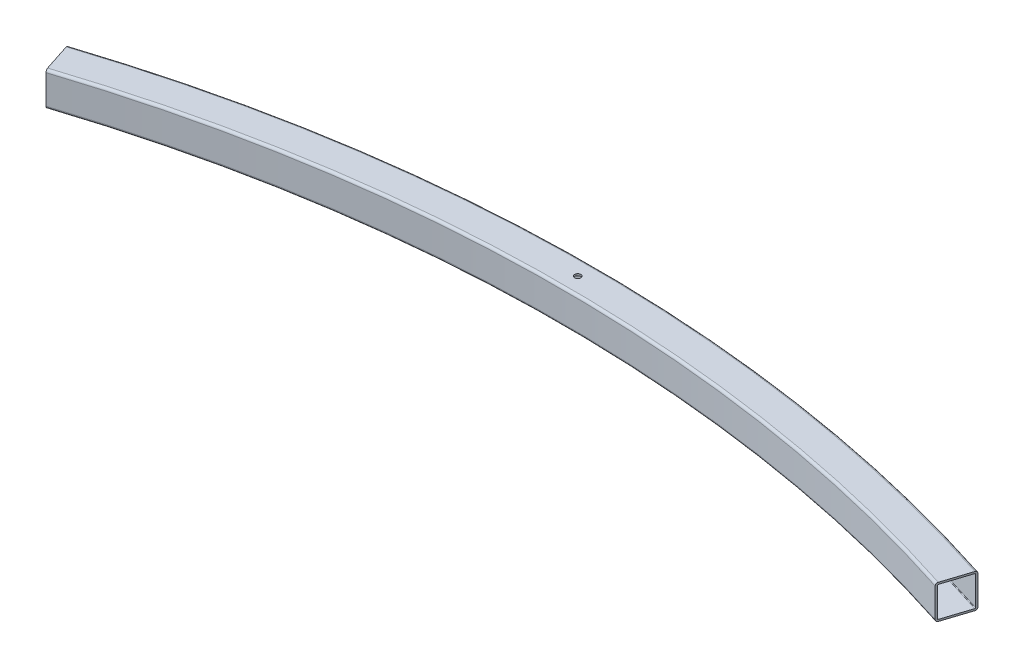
ISO-10303-21;
HEADER;
FILE_DESCRIPTION(('STEP AP214'),'2;1');
FILE_NAME('part.step','',(''),(''),'','','');
FILE_SCHEMA(('AUTOMOTIVE_DESIGN { 1 0 10303 214 1 1 1 1 }'));
ENDSEC;
DATA;
#1=APPLICATION_CONTEXT('core data for automotive mechanical design processes');
#2=APPLICATION_PROTOCOL_DEFINITION('international standard','automotive_design',2000,#1);
#3=PRODUCT_CONTEXT('',#1,'mechanical');
#4=PRODUCT('Part','Part','',(#3));
#5=PRODUCT_RELATED_PRODUCT_CATEGORY('part','',(#4));
#6=PRODUCT_DEFINITION_FORMATION('','',#4);
#7=PRODUCT_DEFINITION_CONTEXT('part definition',#1,'design');
#8=PRODUCT_DEFINITION('design','',#6,#7);
#9=PRODUCT_DEFINITION_SHAPE('','',#8);
#10=(LENGTH_UNIT() NAMED_UNIT(*) SI_UNIT(.MILLI.,.METRE.));
#11=(NAMED_UNIT(*) PLANE_ANGLE_UNIT() SI_UNIT($,.RADIAN.));
#12=(NAMED_UNIT(*) SI_UNIT($,.STERADIAN.) SOLID_ANGLE_UNIT());
#13=UNCERTAINTY_MEASURE_WITH_UNIT(LENGTH_MEASURE(1.E-05),#10,'distance_accuracy_value','');
#14=(GEOMETRIC_REPRESENTATION_CONTEXT(3) GLOBAL_UNCERTAINTY_ASSIGNED_CONTEXT((#13)) GLOBAL_UNIT_ASSIGNED_CONTEXT((#10,
#11,#12)) REPRESENTATION_CONTEXT('',''));
#15=CARTESIAN_POINT('',(0.,0.,0.));
#16=DIRECTION('',(0.,0.,1.));
#17=DIRECTION('',(1.,0.,0.));
#18=AXIS2_PLACEMENT_3D('',#15,#16,#17);
#19=CARTESIAN_POINT('',(0.,64.77,2965.075));
#20=DIRECTION('',(0.,1.,0.));
#21=DIRECTION('',(0.,0.,1.));
#22=AXIS2_PLACEMENT_3D('',#19,#20,#21);
#23=TOROIDAL_SURFACE('',#22,2970.155,1.27);
#24=CARTESIAN_POINT('',(0.,64.77,2965.075));
#25=DIRECTION('',(0.,1.,0.));
#26=DIRECTION('',(0.,0.,1.));
#27=AXIS2_PLACEMENT_3D('',#24,#25,#26);
#28=CIRCLE('',#27,2968.885);
#29=CARTESIAN_POINT('',(914.985616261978,64.77,140.702597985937));
#30=VERTEX_POINT('',#29);
#31=CARTESIAN_POINT('',(-914.985616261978,64.77,140.702597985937));
#32=VERTEX_POINT('',#31);
#33=EDGE_CURVE('E12',#30,#32,#28,.T.);
#34=ORIENTED_EDGE('',*,*,#33,.T.);
#35=CARTESIAN_POINT('',(-915.377019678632,64.77,139.494416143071));
#36=DIRECTION('',(0.951324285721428,0.,-0.308191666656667));
#37=DIRECTION('',(0.308191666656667,0.,0.951324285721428));
#38=AXIS2_PLACEMENT_3D('',#35,#36,#37);
#39=CIRCLE('',#38,1.27);
#40=CARTESIAN_POINT('',(-915.377019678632,66.04,139.494416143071));
#41=VERTEX_POINT('',#40);
#42=EDGE_CURVE('E204',#41,#32,#39,.T.);
#43=ORIENTED_EDGE('',*,*,#42,.F.);
#44=CARTESIAN_POINT('',(0.,66.04,2965.075));
#45=DIRECTION('',(0.,1.,0.));
#46=DIRECTION('',(0.,0.,1.));
#47=AXIS2_PLACEMENT_3D('',#44,#45,#46);
#48=CIRCLE('',#47,2970.155);
#49=CARTESIAN_POINT('',(915.377019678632,66.04,139.494416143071));
#50=VERTEX_POINT('',#49);
#51=EDGE_CURVE('E282',#50,#41,#48,.T.);
#52=ORIENTED_EDGE('',*,*,#51,.F.);
#53=CARTESIAN_POINT('',(915.377019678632,64.77,139.494416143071));
#54=DIRECTION('',(0.951324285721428,0.,0.308191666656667));
#55=DIRECTION('',(-0.308191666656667,0.,0.951324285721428));
#56=AXIS2_PLACEMENT_3D('',#53,#54,#55);
#57=CIRCLE('',#56,1.27);
#58=EDGE_CURVE('E249',#50,#30,#57,.T.);
#59=ORIENTED_EDGE('',*,*,#58,.T.);
#60=EDGE_LOOP('',(#34,#43,#52,#59));
#61=FACE_BOUND('',#60,.T.);
#62=ADVANCED_FACE('F43',(#61),#23,.F.);
#63=CARTESIAN_POINT('',(0.,0.,2965.075));
#64=DIRECTION('',(0.,1.,0.));
#65=DIRECTION('',(0.,0.,1.));
#66=AXIS2_PLACEMENT_3D('',#63,#64,#65);
#67=CYLINDRICAL_SURFACE('',#66,2968.885);
#68=CARTESIAN_POINT('',(0.,5.08,2965.075));
#69=DIRECTION('',(0.,1.,0.));
#70=DIRECTION('',(0.,0.,1.));
#71=AXIS2_PLACEMENT_3D('',#68,#69,#70);
#72=CIRCLE('',#71,2968.885);
#73=CARTESIAN_POINT('',(914.985616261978,5.08,140.702597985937));
#74=VERTEX_POINT('',#73);
#75=CARTESIAN_POINT('',(-914.985616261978,5.08,140.702597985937));
#76=VERTEX_POINT('',#75);
#77=EDGE_CURVE('E52',#74,#76,#72,.T.);
#78=ORIENTED_EDGE('',*,*,#77,.T.);
#79=DIRECTION('',(0.,-1.,0.));
#80=VECTOR('',#79,1.);
#81=CARTESIAN_POINT('',(-914.985616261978,5.08000000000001,140.702597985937));
#82=LINE('',#81,#80);
#83=EDGE_CURVE('E225',#32,#76,#82,.T.);
#84=ORIENTED_EDGE('',*,*,#83,.F.);
#85=ORIENTED_EDGE('',*,*,#33,.F.);
#86=DIRECTION('',(0.,-1.,0.));
#87=VECTOR('',#86,1.);
#88=CARTESIAN_POINT('',(914.985616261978,5.08000000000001,140.702597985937));
#89=LINE('',#88,#87);
#90=EDGE_CURVE('E168',#30,#74,#89,.T.);
#91=ORIENTED_EDGE('',*,*,#90,.T.);
#92=EDGE_LOOP('',(#78,#84,#85,#91));
#93=FACE_BOUND('',#92,.T.);
#94=ADVANCED_FACE('F45',(#93),#67,.T.);
#95=CARTESIAN_POINT('',(0.,5.08,2965.075));
#96=DIRECTION('',(0.,1.,0.));
#97=DIRECTION('',(0.,0.,1.));
#98=AXIS2_PLACEMENT_3D('',#95,#96,#97);
#99=TOROIDAL_SURFACE('',#98,2970.155,1.27);
#100=CARTESIAN_POINT('',(0.,3.81,2965.075));
#101=DIRECTION('',(0.,1.,0.));
#102=DIRECTION('',(0.,0.,1.));
#103=AXIS2_PLACEMENT_3D('',#100,#101,#102);
#104=CIRCLE('',#103,2970.155);
#105=CARTESIAN_POINT('',(915.377019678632,3.81,139.494416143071));
#106=VERTEX_POINT('',#105);
#107=CARTESIAN_POINT('',(-915.377019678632,3.81,139.494416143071));
#108=VERTEX_POINT('',#107);
#109=EDGE_CURVE('E292',#106,#108,#104,.T.);
#110=ORIENTED_EDGE('',*,*,#109,.T.);
#111=CARTESIAN_POINT('',(-915.377019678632,5.08,139.494416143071));
#112=DIRECTION('',(0.951324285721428,0.,-0.308191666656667));
#113=DIRECTION('',(0.308191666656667,0.,0.951324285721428));
#114=AXIS2_PLACEMENT_3D('',#111,#112,#113);
#115=CIRCLE('',#114,1.27);
#116=EDGE_CURVE('E222',#76,#108,#115,.T.);
#117=ORIENTED_EDGE('',*,*,#116,.F.);
#118=ORIENTED_EDGE('',*,*,#77,.F.);
#119=CARTESIAN_POINT('',(915.377019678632,5.08,139.494416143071));
#120=DIRECTION('',(0.951324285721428,0.,0.308191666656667));
#121=DIRECTION('',(-0.308191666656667,0.,0.951324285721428));
#122=AXIS2_PLACEMENT_3D('',#119,#120,#121);
#123=CIRCLE('',#122,1.27);
#124=EDGE_CURVE('E267',#74,#106,#123,.T.);
#125=ORIENTED_EDGE('',*,*,#124,.T.);
#126=EDGE_LOOP('',(#110,#117,#118,#125));
#127=FACE_BOUND('',#126,.T.);
#128=ADVANCED_FACE('F294',(#127),#99,.F.);
#129=CARTESIAN_POINT('',(915.377019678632,3.81,139.494416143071));
#130=DIRECTION('',(0.,1.,0.));
#131=DIRECTION('',(0.,0.,1.));
#132=AXIS2_PLACEMENT_3D('',#129,#130,#131);
#133=PLANE('',#132);
#134=CARTESIAN_POINT('',(0.,3.81,-34.9250000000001));
#135=DIRECTION('',(0.,1.,0.));
#136=DIRECTION('',(0.,0.,1.));
#137=AXIS2_PLACEMENT_3D('',#134,#135,#136);
#138=CIRCLE('',#137,6.35);
#139=CARTESIAN_POINT('',(0.,3.81,-28.5750000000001));
#140=VERTEX_POINT('',#139);
#141=EDGE_CURVE('E183',#140,#140,#138,.T.);
#142=ORIENTED_EDGE('',*,*,#141,.F.);
#143=EDGE_LOOP('',(#142));
#144=FACE_BOUND('',#143,.T.);
#145=CARTESIAN_POINT('',(0.,3.81,2965.075));
#146=DIRECTION('',(0.,1.,0.));
#147=DIRECTION('',(0.,0.,1.));
#148=AXIS2_PLACEMENT_3D('',#145,#146,#147);
#149=CIRCLE('',#148,3029.845);
#150=CARTESIAN_POINT('',(933.772980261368,3.81,82.7098695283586));
#151=VERTEX_POINT('',#150);
#152=CARTESIAN_POINT('',(-933.772980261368,3.81,82.7098695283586));
#153=VERTEX_POINT('',#152);
#154=EDGE_CURVE('E290',#151,#153,#149,.T.);
#155=ORIENTED_EDGE('',*,*,#154,.T.);
#156=DIRECTION('',(-0.308191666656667,0.,-0.951324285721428));
#157=VECTOR('',#156,1.);
#158=CARTESIAN_POINT('',(-915.377019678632,3.81,139.494416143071));
#159=LINE('',#158,#157);
#160=EDGE_CURVE('E219',#108,#153,#159,.T.);
#161=ORIENTED_EDGE('',*,*,#160,.F.);
#162=ORIENTED_EDGE('',*,*,#109,.F.);
#163=DIRECTION('',(0.308191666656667,0.,-0.951324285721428));
#164=VECTOR('',#163,1.);
#165=CARTESIAN_POINT('',(915.377019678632,3.81,139.494416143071));
#166=LINE('',#165,#164);
#167=EDGE_CURVE('E264',#106,#151,#166,.T.);
#168=ORIENTED_EDGE('',*,*,#167,.T.);
#169=EDGE_LOOP('',(#155,#161,#162,#168));
#170=FACE_BOUND('',#169,.T.);
#171=ADVANCED_FACE('F308',(#144,#170),#133,.T.);
#172=CARTESIAN_POINT('',(0.,5.08,2965.075));
#173=DIRECTION('',(0.,1.,0.));
#174=DIRECTION('',(0.,0.,1.));
#175=AXIS2_PLACEMENT_3D('',#172,#173,#174);
#176=TOROIDAL_SURFACE('',#175,3029.845,1.27);
#177=CARTESIAN_POINT('',(0.,5.08000000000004,2965.075));
#178=DIRECTION('',(0.,1.,0.));
#179=DIRECTION('',(0.,0.,1.));
#180=AXIS2_PLACEMENT_3D('',#177,#178,#179);
#181=CIRCLE('',#180,3031.115);
#182=CARTESIAN_POINT('',(934.164383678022,5.08000000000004,81.5016876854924));
#183=VERTEX_POINT('',#182);
#184=CARTESIAN_POINT('',(-934.164383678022,5.08000000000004,81.5016876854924));
#185=VERTEX_POINT('',#184);
#186=EDGE_CURVE('E288',#183,#185,#181,.T.);
#187=ORIENTED_EDGE('',*,*,#186,.T.);
#188=CARTESIAN_POINT('',(-933.772980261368,5.08,82.7098695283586));
#189=DIRECTION('',(0.951324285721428,0.,-0.308191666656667));
#190=DIRECTION('',(-0.308191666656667,0.,-0.951324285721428));
#191=AXIS2_PLACEMENT_3D('',#188,#189,#190);
#192=CIRCLE('',#191,1.27);
#193=EDGE_CURVE('E216',#153,#185,#192,.T.);
#194=ORIENTED_EDGE('',*,*,#193,.F.);
#195=ORIENTED_EDGE('',*,*,#154,.F.);
#196=CARTESIAN_POINT('',(933.772980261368,5.08,82.7098695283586));
#197=DIRECTION('',(0.951324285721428,0.,0.308191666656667));
#198=DIRECTION('',(0.308191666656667,0.,-0.951324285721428));
#199=AXIS2_PLACEMENT_3D('',#196,#197,#198);
#200=CIRCLE('',#199,1.27);
#201=EDGE_CURVE('E261',#151,#183,#200,.T.);
#202=ORIENTED_EDGE('',*,*,#201,.T.);
#203=EDGE_LOOP('',(#187,#194,#195,#202));
#204=FACE_BOUND('',#203,.T.);
#205=ADVANCED_FACE('F312',(#204),#176,.F.);
#206=CARTESIAN_POINT('',(0.,0.,2965.075));
#207=DIRECTION('',(0.,1.,0.));
#208=DIRECTION('',(0.,0.,1.));
#209=AXIS2_PLACEMENT_3D('',#206,#207,#208);
#210=CYLINDRICAL_SURFACE('',#209,3031.115);
#211=CARTESIAN_POINT('',(0.,64.77,2965.075));
#212=DIRECTION('',(0.,1.,0.));
#213=DIRECTION('',(0.,0.,1.));
#214=AXIS2_PLACEMENT_3D('',#211,#212,#213);
#215=CIRCLE('',#214,3031.115);
#216=CARTESIAN_POINT('',(934.164383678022,64.77,81.5016876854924));
#217=VERTEX_POINT('',#216);
#218=CARTESIAN_POINT('',(-934.164383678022,64.77,81.5016876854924));
#219=VERTEX_POINT('',#218);
#220=EDGE_CURVE('E286',#217,#219,#215,.T.);
#221=ORIENTED_EDGE('',*,*,#220,.T.);
#222=DIRECTION('',(0.,1.,0.));
#223=VECTOR('',#222,1.);
#224=CARTESIAN_POINT('',(-934.164383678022,5.08000000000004,81.5016876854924));
#225=LINE('',#224,#223);
#226=EDGE_CURVE('E213',#185,#219,#225,.T.);
#227=ORIENTED_EDGE('',*,*,#226,.F.);
#228=ORIENTED_EDGE('',*,*,#186,.F.);
#229=DIRECTION('',(0.,1.,0.));
#230=VECTOR('',#229,1.);
#231=CARTESIAN_POINT('',(934.164383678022,5.08000000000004,81.5016876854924));
#232=LINE('',#231,#230);
#233=EDGE_CURVE('E258',#183,#217,#232,.T.);
#234=ORIENTED_EDGE('',*,*,#233,.T.);
#235=EDGE_LOOP('',(#221,#227,#228,#234));
#236=FACE_BOUND('',#235,.T.);
#237=ADVANCED_FACE('F314',(#236),#210,.F.);
#238=CARTESIAN_POINT('',(0.,64.77,2965.075));
#239=DIRECTION('',(0.,1.,0.));
#240=DIRECTION('',(0.,0.,1.));
#241=AXIS2_PLACEMENT_3D('',#238,#239,#240);
#242=TOROIDAL_SURFACE('',#241,3029.845,1.27000000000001);
#243=CARTESIAN_POINT('',(0.,66.04,2965.075));
#244=DIRECTION('',(0.,1.,0.));
#245=DIRECTION('',(0.,0.,1.));
#246=AXIS2_PLACEMENT_3D('',#243,#244,#245);
#247=CIRCLE('',#246,3029.845);
#248=CARTESIAN_POINT('',(933.772980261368,66.04,82.7098695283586));
#249=VERTEX_POINT('',#248);
#250=CARTESIAN_POINT('',(-933.772980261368,66.04,82.7098695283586));
#251=VERTEX_POINT('',#250);
#252=EDGE_CURVE('E284',#249,#251,#247,.T.);
#253=ORIENTED_EDGE('',*,*,#252,.T.);
#254=CARTESIAN_POINT('',(-933.772980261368,64.77,82.7098695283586));
#255=DIRECTION('',(0.951324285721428,0.,-0.308191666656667));
#256=DIRECTION('',(0.308191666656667,0.,0.951324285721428));
#257=AXIS2_PLACEMENT_3D('',#254,#255,#256);
#258=CIRCLE('',#257,1.27000000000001);
#259=EDGE_CURVE('E210',#219,#251,#258,.T.);
#260=ORIENTED_EDGE('',*,*,#259,.F.);
#261=ORIENTED_EDGE('',*,*,#220,.F.);
#262=CARTESIAN_POINT('',(933.772980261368,64.77,82.7098695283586));
#263=DIRECTION('',(0.951324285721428,0.,0.308191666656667));
#264=DIRECTION('',(-0.308191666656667,0.,0.951324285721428));
#265=AXIS2_PLACEMENT_3D('',#262,#263,#264);
#266=CIRCLE('',#265,1.27000000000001);
#267=EDGE_CURVE('E255',#217,#249,#266,.T.);
#268=ORIENTED_EDGE('',*,*,#267,.T.);
#269=EDGE_LOOP('',(#253,#260,#261,#268));
#270=FACE_BOUND('',#269,.T.);
#271=ADVANCED_FACE('F317',(#270),#242,.F.);
#272=CARTESIAN_POINT('',(0.,5.08,2965.075));
#273=DIRECTION('',(0.,1.,0.));
#274=DIRECTION('',(0.,0.,1.));
#275=AXIS2_PLACEMENT_3D('',#272,#273,#274);
#276=TOROIDAL_SURFACE('',#275,2970.155,5.08);
#277=CARTESIAN_POINT('',(0.,5.08000000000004,2965.075));
#278=DIRECTION('',(0.,1.,0.));
#279=DIRECTION('',(0.,0.,1.));
#280=AXIS2_PLACEMENT_3D('',#277,#278,#279);
#281=CIRCLE('',#280,2965.075);
#282=CARTESIAN_POINT('',(913.811406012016,5.08000000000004,144.327143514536));
#283=VERTEX_POINT('',#282);
#284=CARTESIAN_POINT('',(-913.811406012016,5.08000000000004,144.327143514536));
#285=VERTEX_POINT('',#284);
#286=EDGE_CURVE('E181',#283,#285,#281,.T.);
#287=ORIENTED_EDGE('',*,*,#286,.T.);
#288=CARTESIAN_POINT('',(-915.377019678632,5.08,139.494416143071));
#289=DIRECTION('',(0.951324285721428,0.,-0.308191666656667));
#290=DIRECTION('',(0.308191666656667,0.,0.951324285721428));
#291=AXIS2_PLACEMENT_3D('',#288,#289,#290);
#292=CIRCLE('',#291,5.08);
#293=CARTESIAN_POINT('',(-915.377019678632,0.,139.494416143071));
#294=VERTEX_POINT('',#293);
#295=EDGE_CURVE('E175',#285,#294,#292,.T.);
#296=ORIENTED_EDGE('',*,*,#295,.T.);
#297=CARTESIAN_POINT('',(0.,0.,2965.075));
#298=DIRECTION('',(0.,1.,0.));
#299=DIRECTION('',(0.,0.,1.));
#300=AXIS2_PLACEMENT_3D('',#297,#298,#299);
#301=CIRCLE('',#300,2970.155);
#302=CARTESIAN_POINT('',(915.377019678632,0.,139.494416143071));
#303=VERTEX_POINT('',#302);
#304=EDGE_CURVE('E156',#303,#294,#301,.T.);
#305=ORIENTED_EDGE('',*,*,#304,.F.);
#306=CARTESIAN_POINT('',(915.377019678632,5.08,139.494416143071));
#307=DIRECTION('',(0.951324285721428,0.,0.308191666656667));
#308=DIRECTION('',(-0.308191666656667,0.,0.951324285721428));
#309=AXIS2_PLACEMENT_3D('',#306,#307,#308);
#310=CIRCLE('',#309,5.08);
#311=EDGE_CURVE('E228',#283,#303,#310,.T.);
#312=ORIENTED_EDGE('',*,*,#311,.F.);
#313=EDGE_LOOP('',(#287,#296,#305,#312));
#314=FACE_BOUND('',#313,.T.);
#315=ADVANCED_FACE('F180',(#314),#276,.T.);
#316=CARTESIAN_POINT('',(0.,0.,2965.075));
#317=DIRECTION('',(0.,1.,0.));
#318=DIRECTION('',(0.,0.,1.));
#319=AXIS2_PLACEMENT_3D('',#316,#317,#318);
#320=CYLINDRICAL_SURFACE('',#319,2965.075);
#321=CARTESIAN_POINT('',(0.,64.77,2965.075));
#322=DIRECTION('',(0.,1.,0.));
#323=DIRECTION('',(0.,0.,1.));
#324=AXIS2_PLACEMENT_3D('',#321,#322,#323);
#325=CIRCLE('',#324,2965.075);
#326=CARTESIAN_POINT('',(913.811406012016,64.77,144.327143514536));
#327=VERTEX_POINT('',#326);
#328=CARTESIAN_POINT('',(-913.811406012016,64.77,144.327143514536));
#329=VERTEX_POINT('',#328);
#330=EDGE_CURVE('E279',#327,#329,#325,.T.);
#331=ORIENTED_EDGE('',*,*,#330,.T.);
#332=DIRECTION('',(0.,-1.,0.));
#333=VECTOR('',#332,1.);
#334=CARTESIAN_POINT('',(-913.811406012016,5.08000000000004,144.327143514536));
#335=LINE('',#334,#333);
#336=EDGE_CURVE('E202',#329,#285,#335,.T.);
#337=ORIENTED_EDGE('',*,*,#336,.T.);
#338=ORIENTED_EDGE('',*,*,#286,.F.);
#339=DIRECTION('',(0.,-1.,0.));
#340=VECTOR('',#339,1.);
#341=CARTESIAN_POINT('',(913.811406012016,5.08000000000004,144.327143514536));
#342=LINE('',#341,#340);
#343=EDGE_CURVE('E246',#327,#283,#342,.T.);
#344=ORIENTED_EDGE('',*,*,#343,.F.);
#345=EDGE_LOOP('',(#331,#337,#338,#344));
#346=FACE_BOUND('',#345,.T.);
#347=ADVANCED_FACE('F340',(#346),#320,.F.);
#348=CARTESIAN_POINT('',(0.,64.77,2965.075));
#349=DIRECTION('',(0.,1.,0.));
#350=DIRECTION('',(0.,0.,1.));
#351=AXIS2_PLACEMENT_3D('',#348,#349,#350);
#352=TOROIDAL_SURFACE('',#351,2970.155,5.08);
#353=CARTESIAN_POINT('',(0.,69.85,2965.075));
#354=DIRECTION('',(0.,1.,0.));
#355=DIRECTION('',(0.,0.,1.));
#356=AXIS2_PLACEMENT_3D('',#353,#354,#355);
#357=CIRCLE('',#356,2970.155);
#358=CARTESIAN_POINT('',(915.377019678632,69.85,139.494416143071));
#359=VERTEX_POINT('',#358);
#360=CARTESIAN_POINT('',(-915.377019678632,69.85,139.494416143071));
#361=VERTEX_POINT('',#360);
#362=EDGE_CURVE('E277',#359,#361,#357,.T.);
#363=ORIENTED_EDGE('',*,*,#362,.T.);
#364=CARTESIAN_POINT('',(-915.377019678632,64.77,139.494416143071));
#365=DIRECTION('',(0.951324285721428,0.,-0.308191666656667));
#366=DIRECTION('',(0.308191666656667,0.,0.951324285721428));
#367=AXIS2_PLACEMENT_3D('',#364,#365,#366);
#368=CIRCLE('',#367,5.08);
#369=EDGE_CURVE('E199',#361,#329,#368,.T.);
#370=ORIENTED_EDGE('',*,*,#369,.T.);
#371=ORIENTED_EDGE('',*,*,#330,.F.);
#372=CARTESIAN_POINT('',(915.377019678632,64.77,139.494416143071));
#373=DIRECTION('',(0.951324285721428,0.,0.308191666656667));
#374=DIRECTION('',(-0.308191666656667,0.,0.951324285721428));
#375=AXIS2_PLACEMENT_3D('',#372,#373,#374);
#376=CIRCLE('',#375,5.08);
#377=EDGE_CURVE('E243',#359,#327,#376,.T.);
#378=ORIENTED_EDGE('',*,*,#377,.F.);
#379=EDGE_LOOP('',(#363,#370,#371,#378));
#380=FACE_BOUND('',#379,.T.);
#381=ADVANCED_FACE('F343',(#380),#352,.T.);
#382=CARTESIAN_POINT('',(915.377019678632,69.85,139.494416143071));
#383=DIRECTION('',(0.,-1.,0.));
#384=DIRECTION('',(0.,0.,-1.));
#385=AXIS2_PLACEMENT_3D('',#382,#383,#384);
#386=PLANE('',#385);
#387=CARTESIAN_POINT('',(0.,69.85,-34.9250000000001));
#388=DIRECTION('',(0.,1.,0.));
#389=DIRECTION('',(0.,0.,1.));
#390=AXIS2_PLACEMENT_3D('',#387,#388,#389);
#391=CIRCLE('',#390,6.35);
#392=CARTESIAN_POINT('',(0.,69.85,-28.5750000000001));
#393=VERTEX_POINT('',#392);
#394=EDGE_CURVE('E379',#393,#393,#391,.T.);
#395=ORIENTED_EDGE('',*,*,#394,.F.);
#396=EDGE_LOOP('',(#395));
#397=FACE_BOUND('',#396,.T.);
#398=CARTESIAN_POINT('',(0.,69.85,2965.075));
#399=DIRECTION('',(0.,1.,0.));
#400=DIRECTION('',(0.,0.,1.));
#401=AXIS2_PLACEMENT_3D('',#398,#399,#400);
#402=CIRCLE('',#401,3029.845);
#403=CARTESIAN_POINT('',(933.772980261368,69.85,82.7098695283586));
#404=VERTEX_POINT('',#403);
#405=CARTESIAN_POINT('',(-933.772980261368,69.85,82.7098695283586));
#406=VERTEX_POINT('',#405);
#407=EDGE_CURVE('E275',#404,#406,#402,.T.);
#408=ORIENTED_EDGE('',*,*,#407,.T.);
#409=DIRECTION('',(0.308191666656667,0.,0.951324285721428));
#410=VECTOR('',#409,1.);
#411=CARTESIAN_POINT('',(-915.377019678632,69.85,139.494416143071));
#412=LINE('',#411,#410);
#413=EDGE_CURVE('E196',#406,#361,#412,.T.);
#414=ORIENTED_EDGE('',*,*,#413,.T.);
#415=ORIENTED_EDGE('',*,*,#362,.F.);
#416=DIRECTION('',(-0.308191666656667,0.,0.951324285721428));
#417=VECTOR('',#416,1.);
#418=CARTESIAN_POINT('',(915.377019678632,69.85,139.494416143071));
#419=LINE('',#418,#417);
#420=EDGE_CURVE('E240',#404,#359,#419,.T.);
#421=ORIENTED_EDGE('',*,*,#420,.F.);
#422=EDGE_LOOP('',(#408,#414,#415,#421));
#423=FACE_BOUND('',#422,.T.);
#424=ADVANCED_FACE('F347',(#397,#423),#386,.F.);
#425=CARTESIAN_POINT('',(0.,64.77,2965.075));
#426=DIRECTION('',(0.,1.,0.));
#427=DIRECTION('',(0.,0.,1.));
#428=AXIS2_PLACEMENT_3D('',#425,#426,#427);
#429=TOROIDAL_SURFACE('',#428,3029.845,5.08);
#430=CARTESIAN_POINT('',(0.,64.77,2965.075));
#431=DIRECTION('',(0.,1.,0.));
#432=DIRECTION('',(0.,0.,1.));
#433=AXIS2_PLACEMENT_3D('',#430,#431,#432);
#434=CIRCLE('',#433,3034.925);
#435=CARTESIAN_POINT('',(935.338593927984,64.77,77.8771421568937));
#436=VERTEX_POINT('',#435);
#437=CARTESIAN_POINT('',(-935.338593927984,64.77,77.8771421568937));
#438=VERTEX_POINT('',#437);
#439=EDGE_CURVE('E273',#436,#438,#434,.T.);
#440=ORIENTED_EDGE('',*,*,#439,.T.);
#441=CARTESIAN_POINT('',(-933.772980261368,64.77,82.7098695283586));
#442=DIRECTION('',(0.951324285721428,0.,-0.308191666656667));
#443=DIRECTION('',(0.308191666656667,0.,0.951324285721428));
#444=AXIS2_PLACEMENT_3D('',#441,#442,#443);
#445=CIRCLE('',#444,5.08);
#446=EDGE_CURVE('E193',#438,#406,#445,.T.);
#447=ORIENTED_EDGE('',*,*,#446,.T.);
#448=ORIENTED_EDGE('',*,*,#407,.F.);
#449=CARTESIAN_POINT('',(933.772980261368,64.77,82.7098695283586));
#450=DIRECTION('',(0.951324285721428,0.,0.308191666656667));
#451=DIRECTION('',(-0.308191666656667,0.,0.951324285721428));
#452=AXIS2_PLACEMENT_3D('',#449,#450,#451);
#453=CIRCLE('',#452,5.08);
#454=EDGE_CURVE('E237',#436,#404,#453,.T.);
#455=ORIENTED_EDGE('',*,*,#454,.F.);
#456=EDGE_LOOP('',(#440,#447,#448,#455));
#457=FACE_BOUND('',#456,.T.);
#458=ADVANCED_FACE('F351',(#457),#429,.T.);
#459=CARTESIAN_POINT('',(0.,0.,2965.075));
#460=DIRECTION('',(0.,1.,0.));
#461=DIRECTION('',(0.,0.,1.));
#462=AXIS2_PLACEMENT_3D('',#459,#460,#461);
#463=CYLINDRICAL_SURFACE('',#462,3034.925);
#464=CARTESIAN_POINT('',(0.,5.08,2965.075));
#465=DIRECTION('',(0.,1.,0.));
#466=DIRECTION('',(0.,0.,1.));
#467=AXIS2_PLACEMENT_3D('',#464,#465,#466);
#468=CIRCLE('',#467,3034.925);
#469=CARTESIAN_POINT('',(935.338593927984,5.08,77.8771421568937));
#470=VERTEX_POINT('',#469);
#471=CARTESIAN_POINT('',(-935.338593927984,5.08,77.8771421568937));
#472=VERTEX_POINT('',#471);
#473=EDGE_CURVE('E271',#470,#472,#468,.T.);
#474=ORIENTED_EDGE('',*,*,#473,.T.);
#475=DIRECTION('',(0.,1.,0.));
#476=VECTOR('',#475,1.);
#477=CARTESIAN_POINT('',(-935.338593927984,5.08000000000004,77.8771421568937));
#478=LINE('',#477,#476);
#479=EDGE_CURVE('E190',#472,#438,#478,.T.);
#480=ORIENTED_EDGE('',*,*,#479,.T.);
#481=ORIENTED_EDGE('',*,*,#439,.F.);
#482=DIRECTION('',(0.,1.,0.));
#483=VECTOR('',#482,1.);
#484=CARTESIAN_POINT('',(935.338593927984,5.08000000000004,77.8771421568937));
#485=LINE('',#484,#483);
#486=EDGE_CURVE('E234',#470,#436,#485,.T.);
#487=ORIENTED_EDGE('',*,*,#486,.F.);
#488=EDGE_LOOP('',(#474,#480,#481,#487));
#489=FACE_BOUND('',#488,.T.);
#490=ADVANCED_FACE('F355',(#489),#463,.T.);
#491=CARTESIAN_POINT('',(0.,5.08,2965.075));
#492=DIRECTION('',(0.,1.,0.));
#493=DIRECTION('',(0.,0.,1.));
#494=AXIS2_PLACEMENT_3D('',#491,#492,#493);
#495=TOROIDAL_SURFACE('',#494,3029.845,5.08);
#496=CARTESIAN_POINT('',(0.,0.,2965.075));
#497=DIRECTION('',(0.,1.,0.));
#498=DIRECTION('',(0.,0.,1.));
#499=AXIS2_PLACEMENT_3D('',#496,#497,#498);
#500=CIRCLE('',#499,3029.845);
#501=CARTESIAN_POINT('',(933.772980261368,0.,82.7098695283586));
#502=VERTEX_POINT('',#501);
#503=CARTESIAN_POINT('',(-933.772980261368,0.,82.7098695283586));
#504=VERTEX_POINT('',#503);
#505=EDGE_CURVE('E167',#502,#504,#500,.T.);
#506=ORIENTED_EDGE('',*,*,#505,.T.);
#507=CARTESIAN_POINT('',(-933.772980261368,5.08,82.7098695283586));
#508=DIRECTION('',(0.951324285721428,0.,-0.308191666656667));
#509=DIRECTION('',(-0.308191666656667,0.,-0.951324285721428));
#510=AXIS2_PLACEMENT_3D('',#507,#508,#509);
#511=CIRCLE('',#510,5.08);
#512=EDGE_CURVE('E178',#504,#472,#511,.T.);
#513=ORIENTED_EDGE('',*,*,#512,.T.);
#514=ORIENTED_EDGE('',*,*,#473,.F.);
#515=CARTESIAN_POINT('',(933.772980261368,5.08,82.7098695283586));
#516=DIRECTION('',(0.951324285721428,0.,0.308191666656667));
#517=DIRECTION('',(0.308191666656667,0.,-0.951324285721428));
#518=AXIS2_PLACEMENT_3D('',#515,#516,#517);
#519=CIRCLE('',#518,5.08);
#520=EDGE_CURVE('E231',#502,#470,#519,.T.);
#521=ORIENTED_EDGE('',*,*,#520,.F.);
#522=EDGE_LOOP('',(#506,#513,#514,#521));
#523=FACE_BOUND('',#522,.T.);
#524=ADVANCED_FACE('F329',(#523),#495,.T.);
#525=CARTESIAN_POINT('',(915.377019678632,0.,139.494416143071));
#526=DIRECTION('',(0.,1.,0.));
#527=DIRECTION('',(0.,0.,1.));
#528=AXIS2_PLACEMENT_3D('',#525,#526,#527);
#529=PLANE('',#528);
#530=CARTESIAN_POINT('',(0.,0.,-34.9250000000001));
#531=DIRECTION('',(0.,1.,0.));
#532=DIRECTION('',(0.,0.,1.));
#533=AXIS2_PLACEMENT_3D('',#530,#531,#532);
#534=CIRCLE('',#533,6.35);
#535=CARTESIAN_POINT('',(0.,0.,-28.5750000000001));
#536=VERTEX_POINT('',#535);
#537=EDGE_CURVE('E380',#536,#536,#534,.T.);
#538=ORIENTED_EDGE('',*,*,#537,.T.);
#539=EDGE_LOOP('',(#538));
#540=FACE_BOUND('',#539,.T.);
#541=DIRECTION('',(0.308191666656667,0.,-0.951324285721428));
#542=VECTOR('',#541,1.);
#543=CARTESIAN_POINT('',(915.377019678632,0.,139.494416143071));
#544=LINE('',#543,#542);
#545=EDGE_CURVE('E162',#303,#502,#544,.T.);
#546=ORIENTED_EDGE('',*,*,#545,.F.);
#547=ORIENTED_EDGE('',*,*,#304,.T.);
#548=DIRECTION('',(-0.308191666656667,0.,-0.951324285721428));
#549=VECTOR('',#548,1.);
#550=CARTESIAN_POINT('',(-915.377019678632,0.,139.494416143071));
#551=LINE('',#550,#549);
#552=EDGE_CURVE('E159',#294,#504,#551,.T.);
#553=ORIENTED_EDGE('',*,*,#552,.T.);
#554=ORIENTED_EDGE('',*,*,#505,.F.);
#555=EDGE_LOOP('',(#546,#547,#553,#554));
#556=FACE_BOUND('',#555,.T.);
#557=ADVANCED_FACE('F158',(#540,#556),#529,.F.);
#558=CARTESIAN_POINT('',(915.377019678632,66.04,139.494416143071));
#559=DIRECTION('',(0.,-1.,0.));
#560=DIRECTION('',(0.,0.,-1.));
#561=AXIS2_PLACEMENT_3D('',#558,#559,#560);
#562=PLANE('',#561);
#563=CARTESIAN_POINT('',(0.,66.04,-34.9250000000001));
#564=DIRECTION('',(0.,-1.,0.));
#565=DIRECTION('',(0.,0.,-1.));
#566=AXIS2_PLACEMENT_3D('',#563,#564,#565);
#567=CIRCLE('',#566,6.35);
#568=CARTESIAN_POINT('',(0.,66.04,-41.2750000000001));
#569=VERTEX_POINT('',#568);
#570=EDGE_CURVE('E47',#569,#569,#567,.T.);
#571=ORIENTED_EDGE('',*,*,#570,.F.);
#572=EDGE_LOOP('',(#571));
#573=FACE_BOUND('',#572,.T.);
#574=DIRECTION('',(-0.308191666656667,0.,0.951324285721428));
#575=VECTOR('',#574,1.);
#576=CARTESIAN_POINT('',(915.377019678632,66.04,139.494416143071));
#577=LINE('',#576,#575);
#578=EDGE_CURVE('E252',#249,#50,#577,.T.);
#579=ORIENTED_EDGE('',*,*,#578,.T.);
#580=ORIENTED_EDGE('',*,*,#51,.T.);
#581=DIRECTION('',(0.308191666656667,0.,0.951324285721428));
#582=VECTOR('',#581,1.);
#583=CARTESIAN_POINT('',(-915.377019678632,66.04,139.494416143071));
#584=LINE('',#583,#582);
#585=EDGE_CURVE('E207',#251,#41,#584,.T.);
#586=ORIENTED_EDGE('',*,*,#585,.F.);
#587=ORIENTED_EDGE('',*,*,#252,.F.);
#588=EDGE_LOOP('',(#579,#580,#586,#587));
#589=FACE_BOUND('',#588,.T.);
#590=ADVANCED_FACE('F319',(#573,#589),#562,.T.);
#591=CARTESIAN_POINT('',(915.377019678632,5.08,139.494416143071));
#592=DIRECTION('',(-0.951324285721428,0.,-0.308191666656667));
#593=DIRECTION('',(-0.308191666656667,0.,0.951324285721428));
#594=AXIS2_PLACEMENT_3D('',#591,#592,#593);
#595=PLANE('',#594);
#596=ORIENTED_EDGE('',*,*,#311,.T.);
#597=ORIENTED_EDGE('',*,*,#545,.T.);
#598=ORIENTED_EDGE('',*,*,#520,.T.);
#599=ORIENTED_EDGE('',*,*,#486,.T.);
#600=ORIENTED_EDGE('',*,*,#454,.T.);
#601=ORIENTED_EDGE('',*,*,#420,.T.);
#602=ORIENTED_EDGE('',*,*,#377,.T.);
#603=ORIENTED_EDGE('',*,*,#343,.T.);
#604=EDGE_LOOP('',(#596,#597,#598,#599,#600,#601,#602,#603));
#605=FACE_BOUND('',#604,.T.);
#606=ORIENTED_EDGE('',*,*,#58,.F.);
#607=ORIENTED_EDGE('',*,*,#578,.F.);
#608=ORIENTED_EDGE('',*,*,#267,.F.);
#609=ORIENTED_EDGE('',*,*,#233,.F.);
#610=ORIENTED_EDGE('',*,*,#201,.F.);
#611=ORIENTED_EDGE('',*,*,#167,.F.);
#612=ORIENTED_EDGE('',*,*,#124,.F.);
#613=ORIENTED_EDGE('',*,*,#90,.F.);
#614=EDGE_LOOP('',(#606,#607,#608,#609,#610,#611,#612,#613));
#615=FACE_BOUND('',#614,.T.);
#616=ADVANCED_FACE('F302',(#605,#615),#595,.F.);
#617=CARTESIAN_POINT('',(-915.377019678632,5.08,139.494416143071));
#618=DIRECTION('',(-0.951324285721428,0.,0.308191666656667));
#619=DIRECTION('',(0.308191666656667,0.,0.951324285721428));
#620=AXIS2_PLACEMENT_3D('',#617,#618,#619);
#621=PLANE('',#620);
#622=ORIENTED_EDGE('',*,*,#295,.F.);
#623=ORIENTED_EDGE('',*,*,#336,.F.);
#624=ORIENTED_EDGE('',*,*,#369,.F.);
#625=ORIENTED_EDGE('',*,*,#413,.F.);
#626=ORIENTED_EDGE('',*,*,#446,.F.);
#627=ORIENTED_EDGE('',*,*,#479,.F.);
#628=ORIENTED_EDGE('',*,*,#512,.F.);
#629=ORIENTED_EDGE('',*,*,#552,.F.);
#630=EDGE_LOOP('',(#622,#623,#624,#625,#626,#627,#628,#629));
#631=FACE_BOUND('',#630,.T.);
#632=ORIENTED_EDGE('',*,*,#42,.T.);
#633=ORIENTED_EDGE('',*,*,#83,.T.);
#634=ORIENTED_EDGE('',*,*,#116,.T.);
#635=ORIENTED_EDGE('',*,*,#160,.T.);
#636=ORIENTED_EDGE('',*,*,#193,.T.);
#637=ORIENTED_EDGE('',*,*,#226,.T.);
#638=ORIENTED_EDGE('',*,*,#259,.T.);
#639=ORIENTED_EDGE('',*,*,#585,.T.);
#640=EDGE_LOOP('',(#632,#633,#634,#635,#636,#637,#638,#639));
#641=FACE_BOUND('',#640,.T.);
#642=ADVANCED_FACE('F172',(#631,#641),#621,.T.);
#643=CARTESIAN_POINT('',(0.,0.,-34.9250000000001));
#644=DIRECTION('',(0.,1.,0.));
#645=DIRECTION('',(0.,0.,1.));
#646=AXIS2_PLACEMENT_3D('',#643,#644,#645);
#647=CYLINDRICAL_SURFACE('',#646,6.35);
#648=ORIENTED_EDGE('',*,*,#570,.T.);
#649=EDGE_LOOP('',(#648));
#650=FACE_BOUND('',#649,.T.);
#651=ORIENTED_EDGE('',*,*,#394,.T.);
#652=EDGE_LOOP('',(#651));
#653=FACE_BOUND('',#652,.T.);
#654=ADVANCED_FACE('F367',(#650,#653),#647,.F.);
#655=ORIENTED_EDGE('',*,*,#141,.T.);
#656=EDGE_LOOP('',(#655));
#657=FACE_BOUND('',#656,.T.);
#658=ORIENTED_EDGE('',*,*,#537,.F.);
#659=EDGE_LOOP('',(#658));
#660=FACE_BOUND('',#659,.T.);
#661=ADVANCED_FACE('F369',(#657,#660),#647,.F.);
#662=CLOSED_SHELL('',(#62,#94,#128,#171,#205,#237,#271,#315,#347,#381,#424,#458,#490,#524,#557,
#590,#616,#642,#654,#661));
#663=MANIFOLD_SOLID_BREP('B2',#662);
#664=ADVANCED_BREP_SHAPE_REPRESENTATION('',(#18,#663),#14);
#665=SHAPE_DEFINITION_REPRESENTATION(#9,#664);
ENDSEC;
END-ISO-10303-21;
